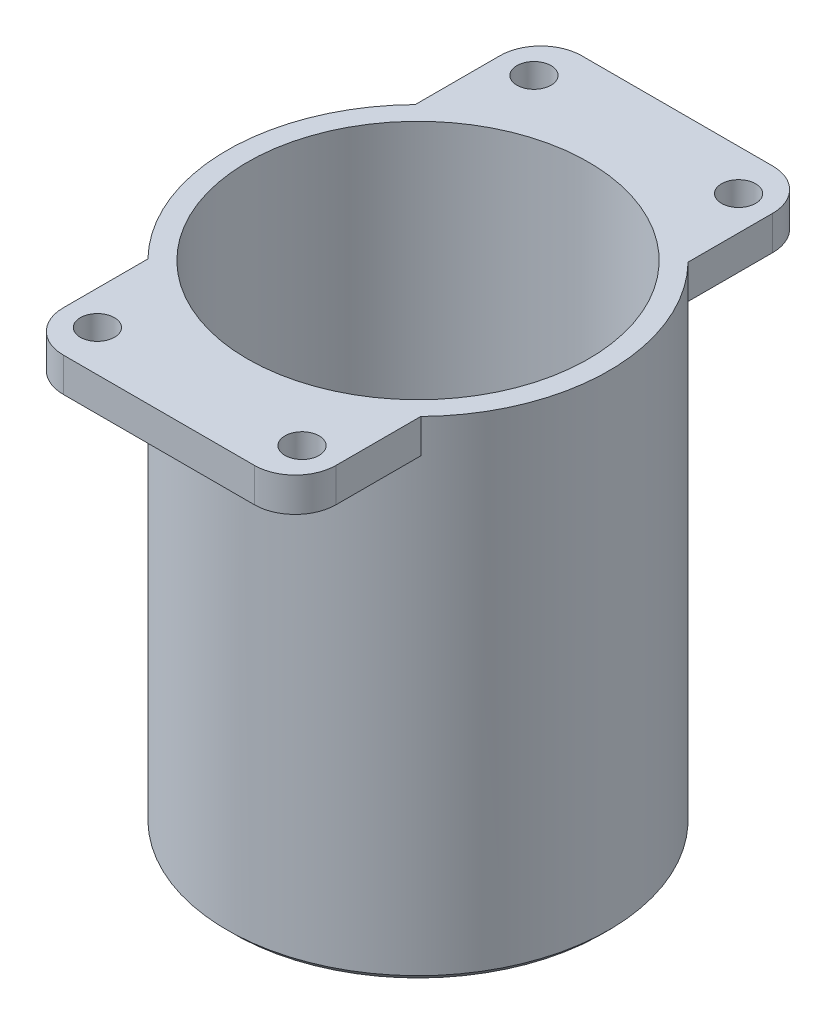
ISO-10303-21;
HEADER;
FILE_DESCRIPTION(('STEP AP214'),'2;1');
FILE_NAME('part.step','',(''),(''),'','','');
FILE_SCHEMA(('AUTOMOTIVE_DESIGN { 1 0 10303 214 1 1 1 1 }'));
ENDSEC;
DATA;
#1=APPLICATION_CONTEXT('core data for automotive mechanical design processes');
#2=APPLICATION_PROTOCOL_DEFINITION('international standard','automotive_design',2000,#1);
#3=PRODUCT_CONTEXT('',#1,'mechanical');
#4=PRODUCT('Part','Part','',(#3));
#5=PRODUCT_RELATED_PRODUCT_CATEGORY('part','',(#4));
#6=PRODUCT_DEFINITION_FORMATION('','',#4);
#7=PRODUCT_DEFINITION_CONTEXT('part definition',#1,'design');
#8=PRODUCT_DEFINITION('design','',#6,#7);
#9=PRODUCT_DEFINITION_SHAPE('','',#8);
#10=(LENGTH_UNIT() NAMED_UNIT(*) SI_UNIT(.MILLI.,.METRE.));
#11=(NAMED_UNIT(*) PLANE_ANGLE_UNIT() SI_UNIT($,.RADIAN.));
#12=(NAMED_UNIT(*) SI_UNIT($,.STERADIAN.) SOLID_ANGLE_UNIT());
#13=UNCERTAINTY_MEASURE_WITH_UNIT(LENGTH_MEASURE(1.E-05),#10,'distance_accuracy_value','');
#14=(GEOMETRIC_REPRESENTATION_CONTEXT(3) GLOBAL_UNCERTAINTY_ASSIGNED_CONTEXT((#13)) GLOBAL_UNIT_ASSIGNED_CONTEXT((#10,
#11,#12)) REPRESENTATION_CONTEXT('',''));
#15=CARTESIAN_POINT('',(0.,0.,0.));
#16=DIRECTION('',(0.,0.,1.));
#17=DIRECTION('',(1.,0.,0.));
#18=AXIS2_PLACEMENT_3D('',#15,#16,#17);
#19=CARTESIAN_POINT('',(0.,56.,0.));
#20=DIRECTION('',(0.,-1.,0.));
#21=DIRECTION('',(0.,0.,-1.));
#22=AXIS2_PLACEMENT_3D('',#19,#20,#21);
#23=CYLINDRICAL_SURFACE('',#22,14.);
#24=CARTESIAN_POINT('',(0.,-1.50000000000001,0.));
#25=DIRECTION('',(0.,-1.,0.));
#26=DIRECTION('',(0.,0.,-1.));
#27=AXIS2_PLACEMENT_3D('',#24,#25,#26);
#28=CIRCLE('',#27,14.);
#29=CARTESIAN_POINT('',(0.,-1.50000000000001,-14.));
#30=VERTEX_POINT('',#29);
#31=EDGE_CURVE('E251',#30,#30,#28,.F.);
#32=ORIENTED_EDGE('',*,*,#31,.T.);
#33=EDGE_LOOP('',(#32));
#34=FACE_BOUND('',#33,.T.);
#35=DIRECTION('',(0.,1.,0.));
#36=VECTOR('',#35,1.);
#37=CARTESIAN_POINT('',(10.,31.5,-9.79795897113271));
#38=LINE('',#37,#36);
#39=CARTESIAN_POINT('',(10.,31.5,-9.79795897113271));
#40=VERTEX_POINT('',#39);
#41=CARTESIAN_POINT('',(10.,34.,-9.7979589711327));
#42=VERTEX_POINT('',#41);
#43=EDGE_CURVE('E178',#40,#42,#38,.T.);
#44=ORIENTED_EDGE('',*,*,#43,.T.);
#45=CARTESIAN_POINT('',(0.,34.,0.));
#46=DIRECTION('',(0.,-1.,0.));
#47=DIRECTION('',(0.,0.,-1.));
#48=AXIS2_PLACEMENT_3D('',#45,#46,#47);
#49=CIRCLE('',#48,14.);
#50=CARTESIAN_POINT('',(10.,34.,9.7979589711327));
#51=VERTEX_POINT('',#50);
#52=EDGE_CURVE('E205',#42,#51,#49,.T.);
#53=ORIENTED_EDGE('',*,*,#52,.T.);
#54=DIRECTION('',(0.,1.,0.));
#55=VECTOR('',#54,1.);
#56=CARTESIAN_POINT('',(10.,33.,9.79795897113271));
#57=LINE('',#56,#55);
#58=CARTESIAN_POINT('',(10.,31.5,9.7979589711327));
#59=VERTEX_POINT('',#58);
#60=EDGE_CURVE('E62',#59,#51,#57,.T.);
#61=ORIENTED_EDGE('',*,*,#60,.F.);
#62=CARTESIAN_POINT('',(0.,31.5,0.));
#63=DIRECTION('',(0.,1.,0.));
#64=DIRECTION('',(0.,0.,-1.));
#65=AXIS2_PLACEMENT_3D('',#62,#63,#64);
#66=CIRCLE('',#65,14.);
#67=CARTESIAN_POINT('',(-10.,31.5,9.79795897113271));
#68=VERTEX_POINT('',#67);
#69=EDGE_CURVE('E198',#68,#59,#66,.T.);
#70=ORIENTED_EDGE('',*,*,#69,.F.);
#71=DIRECTION('',(0.,1.,0.));
#72=VECTOR('',#71,1.);
#73=CARTESIAN_POINT('',(-10.,33.,9.79795897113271));
#74=LINE('',#73,#72);
#75=CARTESIAN_POINT('',(-10.,34.,9.79795897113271));
#76=VERTEX_POINT('',#75);
#77=EDGE_CURVE('E55',#68,#76,#74,.T.);
#78=ORIENTED_EDGE('',*,*,#77,.T.);
#79=CARTESIAN_POINT('',(-10.,34.,-9.79795897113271));
#80=VERTEX_POINT('',#79);
#81=EDGE_CURVE('E206',#76,#80,#49,.T.);
#82=ORIENTED_EDGE('',*,*,#81,.T.);
#83=DIRECTION('',(0.,1.,0.));
#84=VECTOR('',#83,1.);
#85=CARTESIAN_POINT('',(-10.,31.5,-9.79795897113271));
#86=LINE('',#85,#84);
#87=CARTESIAN_POINT('',(-10.,31.5,-9.79795897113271));
#88=VERTEX_POINT('',#87);
#89=EDGE_CURVE('E140',#88,#80,#86,.T.);
#90=ORIENTED_EDGE('',*,*,#89,.F.);
#91=CARTESIAN_POINT('',(0.,31.5,0.));
#92=DIRECTION('',(0.,1.,0.));
#93=DIRECTION('',(0.,0.,1.));
#94=AXIS2_PLACEMENT_3D('',#91,#92,#93);
#95=CIRCLE('',#94,14.);
#96=EDGE_CURVE('E156',#40,#88,#95,.T.);
#97=ORIENTED_EDGE('',*,*,#96,.F.);
#98=EDGE_LOOP('',(#44,#53,#61,#70,#78,#82,#90,#97));
#99=FACE_BOUND('',#98,.T.);
#100=ADVANCED_FACE('F38',(#34,#99),#23,.T.);
#101=CARTESIAN_POINT('',(-14.,33.,19.));
#102=DIRECTION('',(0.,0.,-1.));
#103=DIRECTION('',(-1.,0.,0.));
#104=AXIS2_PLACEMENT_3D('',#101,#102,#103);
#105=PLANE('',#104);
#106=DIRECTION('',(0.,-1.,0.));
#107=VECTOR('',#106,1.);
#108=CARTESIAN_POINT('',(-7.,33.,19.));
#109=LINE('',#108,#107);
#110=CARTESIAN_POINT('',(-7.00000000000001,34.,19.));
#111=VERTEX_POINT('',#110);
#112=CARTESIAN_POINT('',(-7.,31.5,19.));
#113=VERTEX_POINT('',#112);
#114=EDGE_CURVE('E259',#111,#113,#109,.T.);
#115=ORIENTED_EDGE('',*,*,#114,.T.);
#116=DIRECTION('',(-1.,0.,0.));
#117=VECTOR('',#116,1.);
#118=CARTESIAN_POINT('',(7.00000000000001,31.5,19.));
#119=LINE('',#118,#117);
#120=CARTESIAN_POINT('',(7.00000000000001,31.5,19.));
#121=VERTEX_POINT('',#120);
#122=EDGE_CURVE('E189',#121,#113,#119,.T.);
#123=ORIENTED_EDGE('',*,*,#122,.F.);
#124=DIRECTION('',(0.,1.,0.));
#125=VECTOR('',#124,1.);
#126=CARTESIAN_POINT('',(7.00000000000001,41.,19.));
#127=LINE('',#126,#125);
#128=CARTESIAN_POINT('',(7.00000000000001,34.,19.));
#129=VERTEX_POINT('',#128);
#130=EDGE_CURVE('E47',#121,#129,#127,.T.);
#131=ORIENTED_EDGE('',*,*,#130,.T.);
#132=DIRECTION('',(-1.,0.,0.));
#133=VECTOR('',#132,1.);
#134=CARTESIAN_POINT('',(-7.00000000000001,34.,19.));
#135=LINE('',#134,#133);
#136=EDGE_CURVE('E213',#129,#111,#135,.T.);
#137=ORIENTED_EDGE('',*,*,#136,.T.);
#138=EDGE_LOOP('',(#115,#123,#131,#137));
#139=FACE_BOUND('',#138,.T.);
#140=ADVANCED_FACE('F298',(#139),#105,.F.);
#141=CARTESIAN_POINT('',(0.,56.,0.));
#142=DIRECTION('',(0.,-1.,0.));
#143=DIRECTION('',(0.,0.,-1.));
#144=AXIS2_PLACEMENT_3D('',#141,#142,#143);
#145=CYLINDRICAL_SURFACE('',#144,12.5);
#146=CARTESIAN_POINT('',(0.,34.,0.));
#147=DIRECTION('',(0.,1.,0.));
#148=DIRECTION('',(0.,0.,1.));
#149=AXIS2_PLACEMENT_3D('',#146,#147,#148);
#150=CIRCLE('',#149,12.5);
#151=CARTESIAN_POINT('',(0.,34.,12.5));
#152=VERTEX_POINT('',#151);
#153=EDGE_CURVE('E216',#152,#152,#150,.T.);
#154=ORIENTED_EDGE('',*,*,#153,.T.);
#155=EDGE_LOOP('',(#154));
#156=FACE_BOUND('',#155,.T.);
#157=CARTESIAN_POINT('',(0.,0.,0.));
#158=DIRECTION('',(0.,1.,0.));
#159=DIRECTION('',(0.,0.,1.));
#160=AXIS2_PLACEMENT_3D('',#157,#158,#159);
#161=CIRCLE('',#160,12.5);
#162=CARTESIAN_POINT('',(0.,0.,12.5));
#163=VERTEX_POINT('',#162);
#164=EDGE_CURVE('E243',#163,#163,#161,.T.);
#165=ORIENTED_EDGE('',*,*,#164,.F.);
#166=EDGE_LOOP('',(#165));
#167=FACE_BOUND('',#166,.T.);
#168=ADVANCED_FACE('F304',(#156,#167),#145,.F.);
#169=CARTESIAN_POINT('',(0.,0.,0.));
#170=DIRECTION('',(0.,-1.,0.));
#171=DIRECTION('',(0.,0.,-1.));
#172=AXIS2_PLACEMENT_3D('',#169,#170,#171);
#173=PLANE('',#172);
#174=CARTESIAN_POINT('',(9.17629534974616,0.,2.45878092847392));
#175=DIRECTION('',(0.,-1.,0.));
#176=DIRECTION('',(0.,0.,-1.));
#177=AXIS2_PLACEMENT_3D('',#174,#175,#176);
#178=CIRCLE('',#177,1.6);
#179=CARTESIAN_POINT('',(9.17629534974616,0.,0.858780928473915));
#180=VERTEX_POINT('',#179);
#181=EDGE_CURVE('E230',#180,#180,#178,.T.);
#182=ORIENTED_EDGE('',*,*,#181,.T.);
#183=EDGE_LOOP('',(#182));
#184=FACE_BOUND('',#183,.T.);
#185=CARTESIAN_POINT('',(-2.45878092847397,0.,-9.17629534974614));
#186=DIRECTION('',(0.,-1.,0.));
#187=DIRECTION('',(0.,0.,-1.));
#188=AXIS2_PLACEMENT_3D('',#185,#186,#187);
#189=CIRCLE('',#188,1.6);
#190=CARTESIAN_POINT('',(-2.45878092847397,0.,-10.7762953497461));
#191=VERTEX_POINT('',#190);
#192=EDGE_CURVE('E225',#191,#191,#189,.T.);
#193=ORIENTED_EDGE('',*,*,#192,.T.);
#194=EDGE_LOOP('',(#193));
#195=FACE_BOUND('',#194,.T.);
#196=CARTESIAN_POINT('',(-6.71751442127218,0.,6.71751442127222));
#197=DIRECTION('',(0.,-1.,0.));
#198=DIRECTION('',(0.,0.,-1.));
#199=AXIS2_PLACEMENT_3D('',#196,#197,#198);
#200=CIRCLE('',#199,1.6);
#201=CARTESIAN_POINT('',(-6.71751442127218,0.,5.11751442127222));
#202=VERTEX_POINT('',#201);
#203=EDGE_CURVE('E236',#202,#202,#200,.T.);
#204=ORIENTED_EDGE('',*,*,#203,.T.);
#205=EDGE_LOOP('',(#204));
#206=FACE_BOUND('',#205,.T.);
#207=CARTESIAN_POINT('',(0.,0.,0.));
#208=DIRECTION('',(0.,-1.,0.));
#209=DIRECTION('',(0.,0.,-1.));
#210=AXIS2_PLACEMENT_3D('',#207,#208,#209);
#211=CIRCLE('',#210,6.5);
#212=CARTESIAN_POINT('',(0.,0.,-6.5));
#213=VERTEX_POINT('',#212);
#214=EDGE_CURVE('E239',#213,#213,#211,.T.);
#215=ORIENTED_EDGE('',*,*,#214,.T.);
#216=EDGE_LOOP('',(#215));
#217=FACE_BOUND('',#216,.T.);
#218=ORIENTED_EDGE('',*,*,#164,.T.);
#219=EDGE_LOOP('',(#218));
#220=FACE_BOUND('',#219,.T.);
#221=ADVANCED_FACE('F329',(#184,#195,#206,#217,#220),#173,.F.);
#222=CARTESIAN_POINT('',(0.,-2.,0.));
#223=DIRECTION('',(0.,-1.,0.));
#224=DIRECTION('',(0.,0.,-1.));
#225=AXIS2_PLACEMENT_3D('',#222,#223,#224);
#226=PLANE('',#225);
#227=CARTESIAN_POINT('',(0.,-2.,0.));
#228=DIRECTION('',(0.,-1.,0.));
#229=DIRECTION('',(0.,0.,-1.));
#230=AXIS2_PLACEMENT_3D('',#227,#228,#229);
#231=CIRCLE('',#230,13.5);
#232=CARTESIAN_POINT('',(0.,-2.,-13.5));
#233=VERTEX_POINT('',#232);
#234=EDGE_CURVE('E248',#233,#233,#231,.T.);
#235=ORIENTED_EDGE('',*,*,#234,.T.);
#236=EDGE_LOOP('',(#235));
#237=FACE_BOUND('',#236,.T.);
#238=CARTESIAN_POINT('',(9.17629534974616,-2.,2.45878092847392));
#239=DIRECTION('',(0.,-1.,0.));
#240=DIRECTION('',(0.,0.,-1.));
#241=AXIS2_PLACEMENT_3D('',#238,#239,#240);
#242=CIRCLE('',#241,1.6);
#243=CARTESIAN_POINT('',(9.17629534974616,-2.,0.858780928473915));
#244=VERTEX_POINT('',#243);
#245=EDGE_CURVE('E222',#244,#244,#242,.T.);
#246=ORIENTED_EDGE('',*,*,#245,.F.);
#247=EDGE_LOOP('',(#246));
#248=FACE_BOUND('',#247,.T.);
#249=CARTESIAN_POINT('',(-2.45878092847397,-2.,-9.17629534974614));
#250=DIRECTION('',(0.,-1.,0.));
#251=DIRECTION('',(0.,0.,-1.));
#252=AXIS2_PLACEMENT_3D('',#249,#250,#251);
#253=CIRCLE('',#252,1.6);
#254=CARTESIAN_POINT('',(-2.45878092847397,-2.,-10.7762953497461));
#255=VERTEX_POINT('',#254);
#256=EDGE_CURVE('E221',#255,#255,#253,.T.);
#257=ORIENTED_EDGE('',*,*,#256,.F.);
#258=EDGE_LOOP('',(#257));
#259=FACE_BOUND('',#258,.T.);
#260=CARTESIAN_POINT('',(-6.71751442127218,-2.,6.71751442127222));
#261=DIRECTION('',(0.,-1.,0.));
#262=DIRECTION('',(0.,0.,-1.));
#263=AXIS2_PLACEMENT_3D('',#260,#261,#262);
#264=CIRCLE('',#263,1.6);
#265=CARTESIAN_POINT('',(-6.71751442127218,-2.,5.11751442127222));
#266=VERTEX_POINT('',#265);
#267=EDGE_CURVE('E233',#266,#266,#264,.T.);
#268=ORIENTED_EDGE('',*,*,#267,.F.);
#269=EDGE_LOOP('',(#268));
#270=FACE_BOUND('',#269,.T.);
#271=CARTESIAN_POINT('',(0.,-2.,0.));
#272=DIRECTION('',(0.,-1.,0.));
#273=DIRECTION('',(0.,0.,-1.));
#274=AXIS2_PLACEMENT_3D('',#271,#272,#273);
#275=CIRCLE('',#274,6.5);
#276=CARTESIAN_POINT('',(0.,-2.,-6.5));
#277=VERTEX_POINT('',#276);
#278=EDGE_CURVE('E240',#277,#277,#275,.T.);
#279=ORIENTED_EDGE('',*,*,#278,.F.);
#280=EDGE_LOOP('',(#279));
#281=FACE_BOUND('',#280,.T.);
#282=ADVANCED_FACE('F325',(#237,#248,#259,#270,#281),#226,.T.);
#283=CARTESIAN_POINT('',(0.,-2.,0.));
#284=DIRECTION('',(0.,1.,0.));
#285=DIRECTION('',(0.,0.,1.));
#286=AXIS2_PLACEMENT_3D('',#283,#284,#285);
#287=CYLINDRICAL_SURFACE('',#286,6.5);
#288=ORIENTED_EDGE('',*,*,#278,.T.);
#289=EDGE_LOOP('',(#288));
#290=FACE_BOUND('',#289,.T.);
#291=ORIENTED_EDGE('',*,*,#214,.F.);
#292=EDGE_LOOP('',(#291));
#293=FACE_BOUND('',#292,.T.);
#294=ADVANCED_FACE('F328',(#290,#293),#287,.F.);
#295=CARTESIAN_POINT('',(-6.71751442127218,8.,6.71751442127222));
#296=DIRECTION('',(0.,-1.,0.));
#297=DIRECTION('',(0.,0.,-1.));
#298=AXIS2_PLACEMENT_3D('',#295,#296,#297);
#299=CYLINDRICAL_SURFACE('',#298,1.6);
#300=ORIENTED_EDGE('',*,*,#267,.T.);
#301=EDGE_LOOP('',(#300));
#302=FACE_BOUND('',#301,.T.);
#303=ORIENTED_EDGE('',*,*,#203,.F.);
#304=EDGE_LOOP('',(#303));
#305=FACE_BOUND('',#304,.T.);
#306=ADVANCED_FACE('F341',(#302,#305),#299,.F.);
#307=CARTESIAN_POINT('',(-2.45878092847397,8.,-9.17629534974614));
#308=DIRECTION('',(0.,-1.,0.));
#309=DIRECTION('',(0.,0.,-1.));
#310=AXIS2_PLACEMENT_3D('',#307,#308,#309);
#311=CYLINDRICAL_SURFACE('',#310,1.6);
#312=ORIENTED_EDGE('',*,*,#256,.T.);
#313=EDGE_LOOP('',(#312));
#314=FACE_BOUND('',#313,.T.);
#315=ORIENTED_EDGE('',*,*,#192,.F.);
#316=EDGE_LOOP('',(#315));
#317=FACE_BOUND('',#316,.T.);
#318=ADVANCED_FACE('F318',(#314,#317),#311,.F.);
#319=CARTESIAN_POINT('',(9.17629534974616,8.,2.45878092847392));
#320=DIRECTION('',(0.,-1.,0.));
#321=DIRECTION('',(0.,0.,-1.));
#322=AXIS2_PLACEMENT_3D('',#319,#320,#321);
#323=CYLINDRICAL_SURFACE('',#322,1.6);
#324=ORIENTED_EDGE('',*,*,#245,.T.);
#325=EDGE_LOOP('',(#324));
#326=FACE_BOUND('',#325,.T.);
#327=ORIENTED_EDGE('',*,*,#181,.F.);
#328=EDGE_LOOP('',(#327));
#329=FACE_BOUND('',#328,.T.);
#330=ADVANCED_FACE('F311',(#326,#329),#323,.F.);
#331=CARTESIAN_POINT('',(0.,-2.,0.));
#332=DIRECTION('',(0.,1.,0.));
#333=DIRECTION('',(0.,0.,1.));
#334=AXIS2_PLACEMENT_3D('',#331,#332,#333);
#335=CONICAL_SURFACE('',#334,13.5,0.78539816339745);
#336=ORIENTED_EDGE('',*,*,#31,.F.);
#337=EDGE_LOOP('',(#336));
#338=FACE_BOUND('',#337,.T.);
#339=ORIENTED_EDGE('',*,*,#234,.F.);
#340=EDGE_LOOP('',(#339));
#341=FACE_BOUND('',#340,.T.);
#342=ADVANCED_FACE('F309',(#338,#341),#335,.T.);
#343=CARTESIAN_POINT('',(-10.,33.,9.79795897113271));
#344=DIRECTION('',(-1.,0.,0.));
#345=DIRECTION('',(0.,0.,1.));
#346=AXIS2_PLACEMENT_3D('',#343,#344,#345);
#347=PLANE('',#346);
#348=DIRECTION('',(0.,0.,1.));
#349=VECTOR('',#348,1.);
#350=CARTESIAN_POINT('',(-10.,34.,9.79795897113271));
#351=LINE('',#350,#349);
#352=CARTESIAN_POINT('',(-10.,34.,16.));
#353=VERTEX_POINT('',#352);
#354=EDGE_CURVE('E203',#76,#353,#351,.T.);
#355=ORIENTED_EDGE('',*,*,#354,.F.);
#356=ORIENTED_EDGE('',*,*,#77,.F.);
#357=DIRECTION('',(0.,0.,-1.));
#358=VECTOR('',#357,1.);
#359=CARTESIAN_POINT('',(-10.,31.5,16.));
#360=LINE('',#359,#358);
#361=CARTESIAN_POINT('',(-10.,31.5,16.));
#362=VERTEX_POINT('',#361);
#363=EDGE_CURVE('E195',#362,#68,#360,.T.);
#364=ORIENTED_EDGE('',*,*,#363,.F.);
#365=DIRECTION('',(0.,-1.,0.));
#366=VECTOR('',#365,1.);
#367=CARTESIAN_POINT('',(-10.,41.,16.));
#368=LINE('',#367,#366);
#369=EDGE_CURVE('E256',#362,#353,#368,.F.);
#370=ORIENTED_EDGE('',*,*,#369,.T.);
#371=EDGE_LOOP('',(#355,#356,#364,#370));
#372=FACE_BOUND('',#371,.T.);
#373=ADVANCED_FACE('F290',(#372),#347,.T.);
#374=CARTESIAN_POINT('',(10.,33.,9.79795897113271));
#375=DIRECTION('',(1.,0.,0.));
#376=DIRECTION('',(0.,0.,-1.));
#377=AXIS2_PLACEMENT_3D('',#374,#375,#376);
#378=PLANE('',#377);
#379=DIRECTION('',(0.,0.,-1.));
#380=VECTOR('',#379,1.);
#381=CARTESIAN_POINT('',(10.,34.,9.79795897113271));
#382=LINE('',#381,#380);
#383=CARTESIAN_POINT('',(10.,34.,16.));
#384=VERTEX_POINT('',#383);
#385=EDGE_CURVE('E208',#384,#51,#382,.T.);
#386=ORIENTED_EDGE('',*,*,#385,.F.);
#387=DIRECTION('',(0.,1.,0.));
#388=VECTOR('',#387,1.);
#389=CARTESIAN_POINT('',(10.,33.,16.));
#390=LINE('',#389,#388);
#391=CARTESIAN_POINT('',(10.,31.5,16.));
#392=VERTEX_POINT('',#391);
#393=EDGE_CURVE('E254',#384,#392,#390,.F.);
#394=ORIENTED_EDGE('',*,*,#393,.T.);
#395=DIRECTION('',(0.,0.,1.));
#396=VECTOR('',#395,1.);
#397=CARTESIAN_POINT('',(10.,31.5,9.79795897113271));
#398=LINE('',#397,#396);
#399=EDGE_CURVE('E200',#59,#392,#398,.T.);
#400=ORIENTED_EDGE('',*,*,#399,.F.);
#401=ORIENTED_EDGE('',*,*,#60,.T.);
#402=EDGE_LOOP('',(#386,#394,#400,#401));
#403=FACE_BOUND('',#402,.T.);
#404=ADVANCED_FACE('F282',(#403),#378,.T.);
#405=CARTESIAN_POINT('',(0.,34.,0.));
#406=DIRECTION('',(0.,1.,0.));
#407=DIRECTION('',(0.,0.,1.));
#408=AXIS2_PLACEMENT_3D('',#405,#406,#407);
#409=PLANE('',#408);
#410=ORIENTED_EDGE('',*,*,#153,.F.);
#411=EDGE_LOOP('',(#410));
#412=FACE_BOUND('',#411,.T.);
#413=CARTESIAN_POINT('',(7.5,34.,16.));
#414=DIRECTION('',(0.,1.,0.));
#415=DIRECTION('',(0.,0.,1.));
#416=AXIS2_PLACEMENT_3D('',#413,#414,#415);
#417=CIRCLE('',#416,1.25);
#418=CARTESIAN_POINT('',(7.5,34.,17.25));
#419=VERTEX_POINT('',#418);
#420=EDGE_CURVE('E268',#419,#419,#417,.T.);
#421=ORIENTED_EDGE('',*,*,#420,.F.);
#422=EDGE_LOOP('',(#421));
#423=FACE_BOUND('',#422,.T.);
#424=CARTESIAN_POINT('',(7.5,34.,-16.));
#425=DIRECTION('',(0.,1.,0.));
#426=DIRECTION('',(0.,0.,-1.));
#427=AXIS2_PLACEMENT_3D('',#424,#425,#426);
#428=CIRCLE('',#427,1.25);
#429=CARTESIAN_POINT('',(7.5,34.,-17.25));
#430=VERTEX_POINT('',#429);
#431=EDGE_CURVE('E585',#430,#430,#428,.T.);
#432=ORIENTED_EDGE('',*,*,#431,.F.);
#433=EDGE_LOOP('',(#432));
#434=FACE_BOUND('',#433,.T.);
#435=CARTESIAN_POINT('',(-7.5,34.,-16.));
#436=DIRECTION('',(0.,1.,0.));
#437=DIRECTION('',(0.,0.,-1.));
#438=AXIS2_PLACEMENT_3D('',#435,#436,#437);
#439=CIRCLE('',#438,1.25);
#440=CARTESIAN_POINT('',(-7.5,34.,-17.25));
#441=VERTEX_POINT('',#440);
#442=EDGE_CURVE('E588',#441,#441,#439,.T.);
#443=ORIENTED_EDGE('',*,*,#442,.F.);
#444=EDGE_LOOP('',(#443));
#445=FACE_BOUND('',#444,.T.);
#446=CARTESIAN_POINT('',(-7.5,34.,16.));
#447=DIRECTION('',(0.,1.,0.));
#448=DIRECTION('',(0.,0.,1.));
#449=AXIS2_PLACEMENT_3D('',#446,#447,#448);
#450=CIRCLE('',#449,1.25);
#451=CARTESIAN_POINT('',(-7.5,34.,17.25));
#452=VERTEX_POINT('',#451);
#453=EDGE_CURVE('E164',#452,#452,#450,.T.);
#454=ORIENTED_EDGE('',*,*,#453,.F.);
#455=EDGE_LOOP('',(#454));
#456=FACE_BOUND('',#455,.T.);
#457=CARTESIAN_POINT('',(-7.,34.,16.));
#458=DIRECTION('',(0.,-1.,0.));
#459=DIRECTION('',(0.,0.,-1.));
#460=AXIS2_PLACEMENT_3D('',#457,#458,#459);
#461=CIRCLE('',#460,3.);
#462=EDGE_CURVE('E12',#353,#111,#461,.F.);
#463=ORIENTED_EDGE('',*,*,#462,.T.);
#464=ORIENTED_EDGE('',*,*,#136,.F.);
#465=CARTESIAN_POINT('',(7.00000000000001,34.,16.));
#466=DIRECTION('',(0.,-1.,0.));
#467=DIRECTION('',(0.,0.,-1.));
#468=AXIS2_PLACEMENT_3D('',#465,#466,#467);
#469=CIRCLE('',#468,3.);
#470=EDGE_CURVE('E211',#129,#384,#469,.F.);
#471=ORIENTED_EDGE('',*,*,#470,.T.);
#472=ORIENTED_EDGE('',*,*,#385,.T.);
#473=ORIENTED_EDGE('',*,*,#52,.F.);
#474=DIRECTION('',(0.,0.,-1.));
#475=VECTOR('',#474,1.);
#476=CARTESIAN_POINT('',(10.,34.,-9.7979589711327));
#477=LINE('',#476,#475);
#478=CARTESIAN_POINT('',(10.,34.,-16.));
#479=VERTEX_POINT('',#478);
#480=EDGE_CURVE('E149',#42,#479,#477,.T.);
#481=ORIENTED_EDGE('',*,*,#480,.T.);
#482=CARTESIAN_POINT('',(7.00000000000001,34.,-16.));
#483=DIRECTION('',(0.,1.,0.));
#484=DIRECTION('',(0.,0.,1.));
#485=AXIS2_PLACEMENT_3D('',#482,#483,#484);
#486=CIRCLE('',#485,3.);
#487=CARTESIAN_POINT('',(7.00000000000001,34.,-19.));
#488=VERTEX_POINT('',#487);
#489=EDGE_CURVE('E161',#479,#488,#486,.T.);
#490=ORIENTED_EDGE('',*,*,#489,.T.);
#491=DIRECTION('',(-1.,0.,0.));
#492=VECTOR('',#491,1.);
#493=CARTESIAN_POINT('',(7.00000000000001,34.,-19.));
#494=LINE('',#493,#492);
#495=CARTESIAN_POINT('',(-7.,34.,-19.));
#496=VERTEX_POINT('',#495);
#497=EDGE_CURVE('E155',#488,#496,#494,.T.);
#498=ORIENTED_EDGE('',*,*,#497,.T.);
#499=CARTESIAN_POINT('',(-7.,34.,-16.));
#500=DIRECTION('',(0.,1.,0.));
#501=DIRECTION('',(0.,0.,1.));
#502=AXIS2_PLACEMENT_3D('',#499,#500,#501);
#503=CIRCLE('',#502,3.);
#504=CARTESIAN_POINT('',(-10.,34.,-16.));
#505=VERTEX_POINT('',#504);
#506=EDGE_CURVE('E136',#496,#505,#503,.T.);
#507=ORIENTED_EDGE('',*,*,#506,.T.);
#508=DIRECTION('',(0.,0.,1.));
#509=VECTOR('',#508,1.);
#510=CARTESIAN_POINT('',(-10.,34.,-16.));
#511=LINE('',#510,#509);
#512=EDGE_CURVE('E144',#505,#80,#511,.T.);
#513=ORIENTED_EDGE('',*,*,#512,.T.);
#514=ORIENTED_EDGE('',*,*,#81,.F.);
#515=ORIENTED_EDGE('',*,*,#354,.T.);
#516=EDGE_LOOP('',(#463,#464,#471,#472,#473,#481,#490,#498,#507,#513,#514,#515));
#517=FACE_BOUND('',#516,.T.);
#518=ADVANCED_FACE('F152',(#412,#423,#434,#445,#456,#517),#409,.T.);
#519=CARTESIAN_POINT('',(7.00000000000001,33.,16.));
#520=DIRECTION('',(0.,-1.,0.));
#521=DIRECTION('',(0.,0.,-1.));
#522=AXIS2_PLACEMENT_3D('',#519,#520,#521);
#523=CYLINDRICAL_SURFACE('',#522,3.);
#524=ORIENTED_EDGE('',*,*,#470,.F.);
#525=ORIENTED_EDGE('',*,*,#130,.F.);
#526=CARTESIAN_POINT('',(7.00000000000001,31.5,16.));
#527=DIRECTION('',(0.,-1.,0.));
#528=DIRECTION('',(0.,0.,-1.));
#529=AXIS2_PLACEMENT_3D('',#526,#527,#528);
#530=CIRCLE('',#529,3.);
#531=EDGE_CURVE('E186',#392,#121,#530,.T.);
#532=ORIENTED_EDGE('',*,*,#531,.F.);
#533=ORIENTED_EDGE('',*,*,#393,.F.);
#534=EDGE_LOOP('',(#524,#525,#532,#533));
#535=FACE_BOUND('',#534,.T.);
#536=ADVANCED_FACE('F281',(#535),#523,.T.);
#537=CARTESIAN_POINT('',(-7.,33.,16.));
#538=DIRECTION('',(0.,1.,0.));
#539=DIRECTION('',(0.,0.,1.));
#540=AXIS2_PLACEMENT_3D('',#537,#538,#539);
#541=CYLINDRICAL_SURFACE('',#540,3.);
#542=ORIENTED_EDGE('',*,*,#462,.F.);
#543=ORIENTED_EDGE('',*,*,#369,.F.);
#544=CARTESIAN_POINT('',(-7.,31.5,16.));
#545=DIRECTION('',(0.,-1.,0.));
#546=DIRECTION('',(0.,0.,-1.));
#547=AXIS2_PLACEMENT_3D('',#544,#545,#546);
#548=CIRCLE('',#547,3.);
#549=EDGE_CURVE('E192',#113,#362,#548,.T.);
#550=ORIENTED_EDGE('',*,*,#549,.F.);
#551=ORIENTED_EDGE('',*,*,#114,.F.);
#552=EDGE_LOOP('',(#542,#543,#550,#551));
#553=FACE_BOUND('',#552,.T.);
#554=ADVANCED_FACE('F40',(#553),#541,.T.);
#555=CARTESIAN_POINT('',(7.00000000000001,31.5,16.));
#556=DIRECTION('',(0.,-1.,0.));
#557=DIRECTION('',(0.,0.,-1.));
#558=AXIS2_PLACEMENT_3D('',#555,#556,#557);
#559=PLANE('',#558);
#560=CARTESIAN_POINT('',(7.5,31.5,16.));
#561=DIRECTION('',(0.,-1.,0.));
#562=DIRECTION('',(0.,0.,-1.));
#563=AXIS2_PLACEMENT_3D('',#560,#561,#562);
#564=CIRCLE('',#563,1.25);
#565=CARTESIAN_POINT('',(7.5,31.5,14.75));
#566=VERTEX_POINT('',#565);
#567=EDGE_CURVE('E42',#566,#566,#564,.T.);
#568=ORIENTED_EDGE('',*,*,#567,.F.);
#569=EDGE_LOOP('',(#568));
#570=FACE_BOUND('',#569,.T.);
#571=CARTESIAN_POINT('',(-7.5,31.5,16.));
#572=DIRECTION('',(0.,-1.,0.));
#573=DIRECTION('',(0.,0.,-1.));
#574=AXIS2_PLACEMENT_3D('',#571,#572,#573);
#575=CIRCLE('',#574,1.25);
#576=CARTESIAN_POINT('',(-7.5,31.5,14.75));
#577=VERTEX_POINT('',#576);
#578=EDGE_CURVE('E150',#577,#577,#575,.T.);
#579=ORIENTED_EDGE('',*,*,#578,.F.);
#580=EDGE_LOOP('',(#579));
#581=FACE_BOUND('',#580,.T.);
#582=ORIENTED_EDGE('',*,*,#531,.T.);
#583=ORIENTED_EDGE('',*,*,#122,.T.);
#584=ORIENTED_EDGE('',*,*,#549,.T.);
#585=ORIENTED_EDGE('',*,*,#363,.T.);
#586=ORIENTED_EDGE('',*,*,#69,.T.);
#587=ORIENTED_EDGE('',*,*,#399,.T.);
#588=EDGE_LOOP('',(#582,#583,#584,#585,#586,#587));
#589=FACE_BOUND('',#588,.T.);
#590=ADVANCED_FACE('F460',(#570,#581,#589),#559,.T.);
#591=CARTESIAN_POINT('',(-10.,31.5,-16.));
#592=DIRECTION('',(1.,0.,0.));
#593=DIRECTION('',(0.,0.,-1.));
#594=AXIS2_PLACEMENT_3D('',#591,#592,#593);
#595=PLANE('',#594);
#596=ORIENTED_EDGE('',*,*,#89,.T.);
#597=ORIENTED_EDGE('',*,*,#512,.F.);
#598=DIRECTION('',(0.,1.,0.));
#599=VECTOR('',#598,1.);
#600=CARTESIAN_POINT('',(-10.,31.5,-16.));
#601=LINE('',#600,#599);
#602=CARTESIAN_POINT('',(-10.,31.5,-16.));
#603=VERTEX_POINT('',#602);
#604=EDGE_CURVE('E131',#603,#505,#601,.T.);
#605=ORIENTED_EDGE('',*,*,#604,.F.);
#606=DIRECTION('',(0.,0.,-1.));
#607=VECTOR('',#606,1.);
#608=CARTESIAN_POINT('',(-10.,31.5,-16.));
#609=LINE('',#608,#607);
#610=EDGE_CURVE('E159',#88,#603,#609,.T.);
#611=ORIENTED_EDGE('',*,*,#610,.F.);
#612=EDGE_LOOP('',(#596,#597,#605,#611));
#613=FACE_BOUND('',#612,.T.);
#614=ADVANCED_FACE('F145',(#613),#595,.F.);
#615=CARTESIAN_POINT('',(-7.,31.5,-16.));
#616=DIRECTION('',(0.,1.,0.));
#617=DIRECTION('',(0.,0.,1.));
#618=AXIS2_PLACEMENT_3D('',#615,#616,#617);
#619=CYLINDRICAL_SURFACE('',#618,3.);
#620=ORIENTED_EDGE('',*,*,#604,.T.);
#621=ORIENTED_EDGE('',*,*,#506,.F.);
#622=DIRECTION('',(0.,1.,0.));
#623=VECTOR('',#622,1.);
#624=CARTESIAN_POINT('',(-7.,31.5,-19.));
#625=LINE('',#624,#623);
#626=CARTESIAN_POINT('',(-7.,31.5,-19.));
#627=VERTEX_POINT('',#626);
#628=EDGE_CURVE('E141',#627,#496,#625,.T.);
#629=ORIENTED_EDGE('',*,*,#628,.F.);
#630=CARTESIAN_POINT('',(-7.,31.5,-16.));
#631=DIRECTION('',(0.,-1.,0.));
#632=DIRECTION('',(0.,0.,1.));
#633=AXIS2_PLACEMENT_3D('',#630,#631,#632);
#634=CIRCLE('',#633,3.);
#635=EDGE_CURVE('E138',#603,#627,#634,.T.);
#636=ORIENTED_EDGE('',*,*,#635,.F.);
#637=EDGE_LOOP('',(#620,#621,#629,#636));
#638=FACE_BOUND('',#637,.T.);
#639=ADVANCED_FACE('F133',(#638),#619,.T.);
#640=CARTESIAN_POINT('',(7.00000000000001,31.5,-19.));
#641=DIRECTION('',(0.,0.,1.));
#642=DIRECTION('',(1.,0.,0.));
#643=AXIS2_PLACEMENT_3D('',#640,#641,#642);
#644=PLANE('',#643);
#645=ORIENTED_EDGE('',*,*,#628,.T.);
#646=ORIENTED_EDGE('',*,*,#497,.F.);
#647=DIRECTION('',(0.,1.,0.));
#648=VECTOR('',#647,1.);
#649=CARTESIAN_POINT('',(7.00000000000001,31.5,-19.));
#650=LINE('',#649,#648);
#651=CARTESIAN_POINT('',(7.00000000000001,31.5,-19.));
#652=VERTEX_POINT('',#651);
#653=EDGE_CURVE('E182',#652,#488,#650,.T.);
#654=ORIENTED_EDGE('',*,*,#653,.F.);
#655=DIRECTION('',(1.,0.,0.));
#656=VECTOR('',#655,1.);
#657=CARTESIAN_POINT('',(7.00000000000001,31.5,-19.));
#658=LINE('',#657,#656);
#659=EDGE_CURVE('E172',#627,#652,#658,.T.);
#660=ORIENTED_EDGE('',*,*,#659,.F.);
#661=EDGE_LOOP('',(#645,#646,#654,#660));
#662=FACE_BOUND('',#661,.T.);
#663=ADVANCED_FACE('F486',(#662),#644,.F.);
#664=CARTESIAN_POINT('',(7.00000000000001,31.5,-16.));
#665=DIRECTION('',(0.,1.,0.));
#666=DIRECTION('',(0.,0.,1.));
#667=AXIS2_PLACEMENT_3D('',#664,#665,#666);
#668=CYLINDRICAL_SURFACE('',#667,3.);
#669=ORIENTED_EDGE('',*,*,#653,.T.);
#670=ORIENTED_EDGE('',*,*,#489,.F.);
#671=DIRECTION('',(0.,1.,0.));
#672=VECTOR('',#671,1.);
#673=CARTESIAN_POINT('',(10.,31.5,-16.));
#674=LINE('',#673,#672);
#675=CARTESIAN_POINT('',(10.,31.5,-16.));
#676=VERTEX_POINT('',#675);
#677=EDGE_CURVE('E180',#676,#479,#674,.T.);
#678=ORIENTED_EDGE('',*,*,#677,.F.);
#679=CARTESIAN_POINT('',(7.00000000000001,31.5,-16.));
#680=DIRECTION('',(0.,-1.,0.));
#681=DIRECTION('',(0.,0.,1.));
#682=AXIS2_PLACEMENT_3D('',#679,#680,#681);
#683=CIRCLE('',#682,3.);
#684=EDGE_CURVE('E174',#652,#676,#683,.T.);
#685=ORIENTED_EDGE('',*,*,#684,.F.);
#686=EDGE_LOOP('',(#669,#670,#678,#685));
#687=FACE_BOUND('',#686,.T.);
#688=ADVANCED_FACE('F496',(#687),#668,.T.);
#689=CARTESIAN_POINT('',(10.,31.5,-9.79795897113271));
#690=DIRECTION('',(-1.,0.,0.));
#691=DIRECTION('',(0.,0.,1.));
#692=AXIS2_PLACEMENT_3D('',#689,#690,#691);
#693=PLANE('',#692);
#694=ORIENTED_EDGE('',*,*,#677,.T.);
#695=ORIENTED_EDGE('',*,*,#480,.F.);
#696=ORIENTED_EDGE('',*,*,#43,.F.);
#697=DIRECTION('',(0.,0.,1.));
#698=VECTOR('',#697,1.);
#699=CARTESIAN_POINT('',(10.,31.5,-9.79795897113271));
#700=LINE('',#699,#698);
#701=EDGE_CURVE('E176',#676,#40,#700,.T.);
#702=ORIENTED_EDGE('',*,*,#701,.F.);
#703=EDGE_LOOP('',(#694,#695,#696,#702));
#704=FACE_BOUND('',#703,.T.);
#705=ADVANCED_FACE('F507',(#704),#693,.F.);
#706=CARTESIAN_POINT('',(0.,31.5,0.));
#707=DIRECTION('',(0.,1.,0.));
#708=DIRECTION('',(0.,0.,1.));
#709=AXIS2_PLACEMENT_3D('',#706,#707,#708);
#710=PLANE('',#709);
#711=CARTESIAN_POINT('',(7.5,31.5,-16.));
#712=DIRECTION('',(0.,1.,0.));
#713=DIRECTION('',(0.,0.,1.));
#714=AXIS2_PLACEMENT_3D('',#711,#712,#713);
#715=CIRCLE('',#714,1.25);
#716=CARTESIAN_POINT('',(7.5,31.5,-14.75));
#717=VERTEX_POINT('',#716);
#718=EDGE_CURVE('E267',#717,#717,#715,.T.);
#719=ORIENTED_EDGE('',*,*,#718,.T.);
#720=EDGE_LOOP('',(#719));
#721=FACE_BOUND('',#720,.T.);
#722=CARTESIAN_POINT('',(-7.5,31.5,-16.));
#723=DIRECTION('',(0.,1.,0.));
#724=DIRECTION('',(0.,0.,1.));
#725=AXIS2_PLACEMENT_3D('',#722,#723,#724);
#726=CIRCLE('',#725,1.25);
#727=CARTESIAN_POINT('',(-7.5,31.5,-14.75));
#728=VERTEX_POINT('',#727);
#729=EDGE_CURVE('E265',#728,#728,#726,.T.);
#730=ORIENTED_EDGE('',*,*,#729,.T.);
#731=EDGE_LOOP('',(#730));
#732=FACE_BOUND('',#731,.T.);
#733=ORIENTED_EDGE('',*,*,#96,.T.);
#734=ORIENTED_EDGE('',*,*,#610,.T.);
#735=ORIENTED_EDGE('',*,*,#635,.T.);
#736=ORIENTED_EDGE('',*,*,#659,.T.);
#737=ORIENTED_EDGE('',*,*,#684,.T.);
#738=ORIENTED_EDGE('',*,*,#701,.T.);
#739=EDGE_LOOP('',(#733,#734,#735,#736,#737,#738));
#740=FACE_BOUND('',#739,.T.);
#741=ADVANCED_FACE('F518',(#721,#732,#740),#710,.F.);
#742=CARTESIAN_POINT('',(-7.5,24.,16.));
#743=DIRECTION('',(0.,1.,0.));
#744=DIRECTION('',(0.,0.,1.));
#745=AXIS2_PLACEMENT_3D('',#742,#743,#744);
#746=CYLINDRICAL_SURFACE('',#745,1.25);
#747=ORIENTED_EDGE('',*,*,#578,.T.);
#748=EDGE_LOOP('',(#747));
#749=FACE_BOUND('',#748,.T.);
#750=ORIENTED_EDGE('',*,*,#453,.T.);
#751=EDGE_LOOP('',(#750));
#752=FACE_BOUND('',#751,.T.);
#753=ADVANCED_FACE('F278',(#749,#752),#746,.F.);
#754=CARTESIAN_POINT('',(-7.5,24.,-16.));
#755=DIRECTION('',(0.,1.,0.));
#756=DIRECTION('',(0.,0.,1.));
#757=AXIS2_PLACEMENT_3D('',#754,#755,#756);
#758=CYLINDRICAL_SURFACE('',#757,1.25);
#759=ORIENTED_EDGE('',*,*,#442,.T.);
#760=EDGE_LOOP('',(#759));
#761=FACE_BOUND('',#760,.T.);
#762=ORIENTED_EDGE('',*,*,#729,.F.);
#763=EDGE_LOOP('',(#762));
#764=FACE_BOUND('',#763,.T.);
#765=ADVANCED_FACE('F544',(#761,#764),#758,.F.);
#766=CARTESIAN_POINT('',(7.5,24.,-16.));
#767=DIRECTION('',(0.,1.,0.));
#768=DIRECTION('',(0.,0.,1.));
#769=AXIS2_PLACEMENT_3D('',#766,#767,#768);
#770=CYLINDRICAL_SURFACE('',#769,1.25);
#771=ORIENTED_EDGE('',*,*,#431,.T.);
#772=EDGE_LOOP('',(#771));
#773=FACE_BOUND('',#772,.T.);
#774=ORIENTED_EDGE('',*,*,#718,.F.);
#775=EDGE_LOOP('',(#774));
#776=FACE_BOUND('',#775,.T.);
#777=ADVANCED_FACE('F556',(#773,#776),#770,.F.);
#778=CARTESIAN_POINT('',(7.5,24.,16.));
#779=DIRECTION('',(0.,1.,0.));
#780=DIRECTION('',(0.,0.,1.));
#781=AXIS2_PLACEMENT_3D('',#778,#779,#780);
#782=CYLINDRICAL_SURFACE('',#781,1.25);
#783=ORIENTED_EDGE('',*,*,#567,.T.);
#784=EDGE_LOOP('',(#783));
#785=FACE_BOUND('',#784,.T.);
#786=ORIENTED_EDGE('',*,*,#420,.T.);
#787=EDGE_LOOP('',(#786));
#788=FACE_BOUND('',#787,.T.);
#789=ADVANCED_FACE('F566',(#785,#788),#782,.F.);
#790=CLOSED_SHELL('',(#100,#140,#168,#221,#282,#294,#306,#318,#330,#342,#373,#404,#518,#536,
#554,#590,#614,#639,#663,#688,#705,#741,#753,#765,#777,#789));
#791=MANIFOLD_SOLID_BREP('B2',#790);
#792=ADVANCED_BREP_SHAPE_REPRESENTATION('',(#18,#791),#14);
#793=SHAPE_DEFINITION_REPRESENTATION(#9,#792);
ENDSEC;
END-ISO-10303-21;
